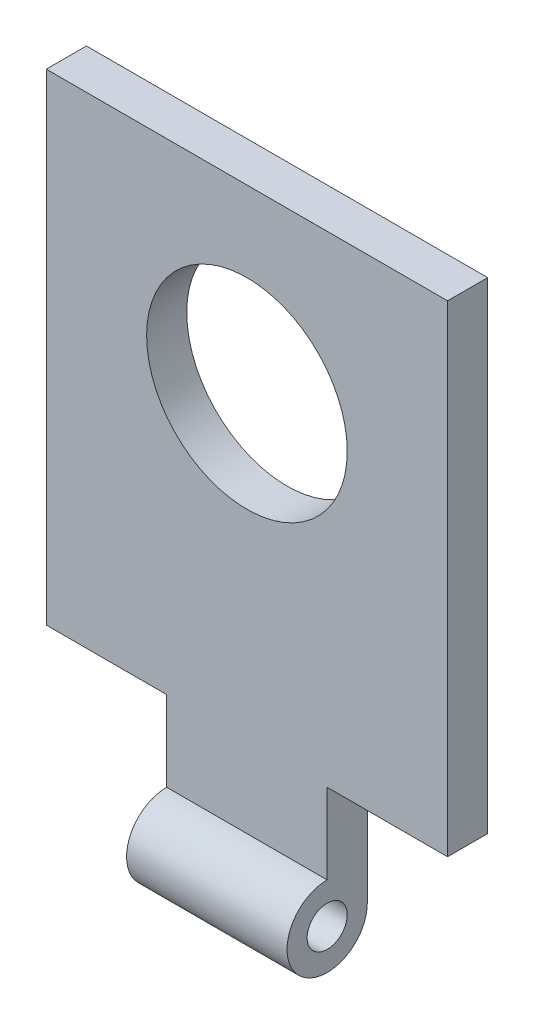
ISO-10303-21;
HEADER;
FILE_DESCRIPTION(('STEP AP214'),'2;1');
FILE_NAME('part.step','',(''),(''),'','','');
FILE_SCHEMA(('AUTOMOTIVE_DESIGN { 1 0 10303 214 1 1 1 1 }'));
ENDSEC;
DATA;
#1=APPLICATION_CONTEXT('core data for automotive mechanical design processes');
#2=APPLICATION_PROTOCOL_DEFINITION('international standard','automotive_design',2000,#1);
#3=PRODUCT_CONTEXT('',#1,'mechanical');
#4=PRODUCT('Part','Part','',(#3));
#5=PRODUCT_RELATED_PRODUCT_CATEGORY('part','',(#4));
#6=PRODUCT_DEFINITION_FORMATION('','',#4);
#7=PRODUCT_DEFINITION_CONTEXT('part definition',#1,'design');
#8=PRODUCT_DEFINITION('design','',#6,#7);
#9=PRODUCT_DEFINITION_SHAPE('','',#8);
#10=(LENGTH_UNIT() NAMED_UNIT(*) SI_UNIT(.MILLI.,.METRE.));
#11=(NAMED_UNIT(*) PLANE_ANGLE_UNIT() SI_UNIT($,.RADIAN.));
#12=(NAMED_UNIT(*) SI_UNIT($,.STERADIAN.) SOLID_ANGLE_UNIT());
#13=UNCERTAINTY_MEASURE_WITH_UNIT(LENGTH_MEASURE(1.E-05),#10,'distance_accuracy_value','');
#14=(GEOMETRIC_REPRESENTATION_CONTEXT(3) GLOBAL_UNCERTAINTY_ASSIGNED_CONTEXT((#13)) GLOBAL_UNIT_ASSIGNED_CONTEXT((#10,
#11,#12)) REPRESENTATION_CONTEXT('',''));
#15=CARTESIAN_POINT('',(0.,0.,0.));
#16=DIRECTION('',(0.,0.,1.));
#17=DIRECTION('',(1.,0.,0.));
#18=AXIS2_PLACEMENT_3D('',#15,#16,#17);
#19=CARTESIAN_POINT('',(0.,0.,10.));
#20=DIRECTION('',(0.,0.,1.));
#21=DIRECTION('',(1.,0.,0.));
#22=AXIS2_PLACEMENT_3D('',#19,#20,#21);
#23=PLANE('',#22);
#24=DIRECTION('',(-1.,0.,0.));
#25=VECTOR('',#24,1.);
#26=CARTESIAN_POINT('',(98.2842712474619,10.,10.));
#27=LINE('',#26,#25);
#28=CARTESIAN_POINT('',(70.,10.,10.));
#29=VERTEX_POINT('',#28);
#30=CARTESIAN_POINT('',(30.,10.,10.));
#31=VERTEX_POINT('',#30);
#32=EDGE_CURVE('E170',#29,#31,#27,.T.);
#33=ORIENTED_EDGE('',*,*,#32,.F.);
#34=DIRECTION('',(0.,1.,0.));
#35=VECTOR('',#34,1.);
#36=CARTESIAN_POINT('',(70.,30.,10.));
#37=LINE('',#36,#35);
#38=CARTESIAN_POINT('',(70.,30.,10.));
#39=VERTEX_POINT('',#38);
#40=EDGE_CURVE('E91',#29,#39,#37,.T.);
#41=ORIENTED_EDGE('',*,*,#40,.T.);
#42=DIRECTION('',(1.,0.,0.));
#43=VECTOR('',#42,1.);
#44=CARTESIAN_POINT('',(70.,30.,10.));
#45=LINE('',#44,#43);
#46=CARTESIAN_POINT('',(100.,30.,10.));
#47=VERTEX_POINT('',#46);
#48=EDGE_CURVE('E187',#39,#47,#45,.T.);
#49=ORIENTED_EDGE('',*,*,#48,.T.);
#50=DIRECTION('',(0.,1.,0.));
#51=VECTOR('',#50,1.);
#52=CARTESIAN_POINT('',(100.,30.,10.));
#53=LINE('',#52,#51);
#54=CARTESIAN_POINT('',(100.,150.,10.));
#55=VERTEX_POINT('',#54);
#56=EDGE_CURVE('E108',#47,#55,#53,.T.);
#57=ORIENTED_EDGE('',*,*,#56,.T.);
#58=DIRECTION('',(-1.,0.,0.));
#59=VECTOR('',#58,1.);
#60=CARTESIAN_POINT('',(0.,150.,10.));
#61=LINE('',#60,#59);
#62=CARTESIAN_POINT('',(0.,150.,10.));
#63=VERTEX_POINT('',#62);
#64=EDGE_CURVE('E101',#55,#63,#61,.T.);
#65=ORIENTED_EDGE('',*,*,#64,.T.);
#66=DIRECTION('',(0.,-1.,0.));
#67=VECTOR('',#66,1.);
#68=CARTESIAN_POINT('',(0.,30.,10.));
#69=LINE('',#68,#67);
#70=CARTESIAN_POINT('',(0.,30.,10.));
#71=VERTEX_POINT('',#70);
#72=EDGE_CURVE('E105',#63,#71,#69,.T.);
#73=ORIENTED_EDGE('',*,*,#72,.T.);
#74=DIRECTION('',(1.,0.,0.));
#75=VECTOR('',#74,1.);
#76=CARTESIAN_POINT('',(30.,30.,10.));
#77=LINE('',#76,#75);
#78=CARTESIAN_POINT('',(30.,30.,10.));
#79=VERTEX_POINT('',#78);
#80=EDGE_CURVE('E50',#71,#79,#77,.T.);
#81=ORIENTED_EDGE('',*,*,#80,.T.);
#82=DIRECTION('',(0.,-1.,0.));
#83=VECTOR('',#82,1.);
#84=CARTESIAN_POINT('',(30.,30.,10.));
#85=LINE('',#84,#83);
#86=EDGE_CURVE('E125',#79,#31,#85,.T.);
#87=ORIENTED_EDGE('',*,*,#86,.T.);
#88=EDGE_LOOP('',(#33,#41,#49,#57,#65,#73,#81,#87));
#89=FACE_BOUND('',#88,.T.);
#90=CARTESIAN_POINT('',(50.,105.,10.));
#91=DIRECTION('',(0.,0.,1.));
#92=DIRECTION('',(1.,0.,0.));
#93=AXIS2_PLACEMENT_3D('',#90,#91,#92);
#94=CIRCLE('',#93,25.);
#95=CARTESIAN_POINT('',(75.,105.,10.));
#96=VERTEX_POINT('',#95);
#97=EDGE_CURVE('E134',#96,#96,#94,.T.);
#98=ORIENTED_EDGE('',*,*,#97,.F.);
#99=EDGE_LOOP('',(#98));
#100=FACE_BOUND('',#99,.T.);
#101=ADVANCED_FACE('F33',(#89,#100),#23,.T.);
#102=CARTESIAN_POINT('',(0.,0.,0.));
#103=DIRECTION('',(0.,0.,1.));
#104=DIRECTION('',(1.,0.,0.));
#105=AXIS2_PLACEMENT_3D('',#102,#103,#104);
#106=PLANE('',#105);
#107=DIRECTION('',(0.,1.,0.));
#108=VECTOR('',#107,1.);
#109=CARTESIAN_POINT('',(70.,30.,0.));
#110=LINE('',#109,#108);
#111=CARTESIAN_POINT('',(70.,0.,0.));
#112=VERTEX_POINT('',#111);
#113=CARTESIAN_POINT('',(70.,30.,0.));
#114=VERTEX_POINT('',#113);
#115=EDGE_CURVE('E131',#112,#114,#110,.T.);
#116=ORIENTED_EDGE('',*,*,#115,.F.);
#117=DIRECTION('',(1.,0.,0.));
#118=VECTOR('',#117,1.);
#119=CARTESIAN_POINT('',(30.,0.,0.));
#120=LINE('',#119,#118);
#121=CARTESIAN_POINT('',(30.,0.,0.));
#122=VERTEX_POINT('',#121);
#123=EDGE_CURVE('E145',#122,#112,#120,.T.);
#124=ORIENTED_EDGE('',*,*,#123,.F.);
#125=DIRECTION('',(0.,-1.,0.));
#126=VECTOR('',#125,1.);
#127=CARTESIAN_POINT('',(30.,30.,0.));
#128=LINE('',#127,#126);
#129=CARTESIAN_POINT('',(30.,30.,0.));
#130=VERTEX_POINT('',#129);
#131=EDGE_CURVE('E142',#130,#122,#128,.T.);
#132=ORIENTED_EDGE('',*,*,#131,.F.);
#133=DIRECTION('',(1.,0.,0.));
#134=VECTOR('',#133,1.);
#135=CARTESIAN_POINT('',(30.,30.,0.));
#136=LINE('',#135,#134);
#137=CARTESIAN_POINT('',(0.,30.,0.));
#138=VERTEX_POINT('',#137);
#139=EDGE_CURVE('E76',#138,#130,#136,.T.);
#140=ORIENTED_EDGE('',*,*,#139,.F.);
#141=DIRECTION('',(0.,-1.,0.));
#142=VECTOR('',#141,1.);
#143=CARTESIAN_POINT('',(0.,30.,0.));
#144=LINE('',#143,#142);
#145=CARTESIAN_POINT('',(0.,150.,0.));
#146=VERTEX_POINT('',#145);
#147=EDGE_CURVE('E139',#146,#138,#144,.T.);
#148=ORIENTED_EDGE('',*,*,#147,.F.);
#149=DIRECTION('',(-1.,0.,0.));
#150=VECTOR('',#149,1.);
#151=CARTESIAN_POINT('',(0.,150.,0.));
#152=LINE('',#151,#150);
#153=CARTESIAN_POINT('',(100.,150.,0.));
#154=VERTEX_POINT('',#153);
#155=EDGE_CURVE('E117',#154,#146,#152,.T.);
#156=ORIENTED_EDGE('',*,*,#155,.F.);
#157=DIRECTION('',(0.,1.,0.));
#158=VECTOR('',#157,1.);
#159=CARTESIAN_POINT('',(100.,30.,0.));
#160=LINE('',#159,#158);
#161=CARTESIAN_POINT('',(100.,30.,0.));
#162=VERTEX_POINT('',#161);
#163=EDGE_CURVE('E136',#162,#154,#160,.T.);
#164=ORIENTED_EDGE('',*,*,#163,.F.);
#165=DIRECTION('',(1.,0.,0.));
#166=VECTOR('',#165,1.);
#167=CARTESIAN_POINT('',(70.,30.,0.));
#168=LINE('',#167,#166);
#169=EDGE_CURVE('E133',#114,#162,#168,.T.);
#170=ORIENTED_EDGE('',*,*,#169,.F.);
#171=EDGE_LOOP('',(#116,#124,#132,#140,#148,#156,#164,#170));
#172=FACE_BOUND('',#171,.T.);
#173=CARTESIAN_POINT('',(50.,105.,0.));
#174=DIRECTION('',(0.,0.,1.));
#175=DIRECTION('',(1.,0.,0.));
#176=AXIS2_PLACEMENT_3D('',#173,#174,#175);
#177=CIRCLE('',#176,25.);
#178=CARTESIAN_POINT('',(75.,105.,0.));
#179=VERTEX_POINT('',#178);
#180=EDGE_CURVE('E176',#179,#179,#177,.T.);
#181=ORIENTED_EDGE('',*,*,#180,.T.);
#182=EDGE_LOOP('',(#181));
#183=FACE_BOUND('',#182,.T.);
#184=ADVANCED_FACE('F157',(#172,#183),#106,.F.);
#185=CARTESIAN_POINT('',(70.,30.,10.));
#186=DIRECTION('',(-1.,0.,0.));
#187=DIRECTION('',(0.,-1.,0.));
#188=AXIS2_PLACEMENT_3D('',#185,#186,#187);
#189=PLANE('',#188);
#190=CARTESIAN_POINT('',(70.,0.,10.));
#191=DIRECTION('',(-1.,0.,0.));
#192=DIRECTION('',(0.,-1.,0.));
#193=AXIS2_PLACEMENT_3D('',#190,#191,#192);
#194=CIRCLE('',#193,5.);
#195=CARTESIAN_POINT('',(70.,-4.99999999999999,10.));
#196=VERTEX_POINT('',#195);
#197=EDGE_CURVE('E178',#196,#196,#194,.T.);
#198=ORIENTED_EDGE('',*,*,#197,.T.);
#199=EDGE_LOOP('',(#198));
#200=FACE_BOUND('',#199,.T.);
#201=ORIENTED_EDGE('',*,*,#40,.F.);
#202=CARTESIAN_POINT('',(70.,0.,10.));
#203=DIRECTION('',(-1.,0.,0.));
#204=DIRECTION('',(0.,-1.,0.));
#205=AXIS2_PLACEMENT_3D('',#202,#203,#204);
#206=CIRCLE('',#205,10.);
#207=EDGE_CURVE('E84',#29,#112,#206,.F.);
#208=ORIENTED_EDGE('',*,*,#207,.T.);
#209=ORIENTED_EDGE('',*,*,#115,.T.);
#210=DIRECTION('',(0.,0.,-1.));
#211=VECTOR('',#210,1.);
#212=CARTESIAN_POINT('',(70.,30.,10.));
#213=LINE('',#212,#211);
#214=EDGE_CURVE('E11',#39,#114,#213,.T.);
#215=ORIENTED_EDGE('',*,*,#214,.F.);
#216=EDGE_LOOP('',(#201,#208,#209,#215));
#217=FACE_BOUND('',#216,.T.);
#218=ADVANCED_FACE('F35',(#200,#217),#189,.F.);
#219=CARTESIAN_POINT('',(70.,30.,10.));
#220=DIRECTION('',(0.,1.,0.));
#221=DIRECTION('',(-1.,0.,0.));
#222=AXIS2_PLACEMENT_3D('',#219,#220,#221);
#223=PLANE('',#222);
#224=ORIENTED_EDGE('',*,*,#169,.T.);
#225=DIRECTION('',(0.,0.,-1.));
#226=VECTOR('',#225,1.);
#227=CARTESIAN_POINT('',(100.,30.,10.));
#228=LINE('',#227,#226);
#229=EDGE_CURVE('E42',#47,#162,#228,.T.);
#230=ORIENTED_EDGE('',*,*,#229,.F.);
#231=ORIENTED_EDGE('',*,*,#48,.F.);
#232=ORIENTED_EDGE('',*,*,#214,.T.);
#233=EDGE_LOOP('',(#224,#230,#231,#232));
#234=FACE_BOUND('',#233,.T.);
#235=ADVANCED_FACE('F189',(#234),#223,.F.);
#236=CARTESIAN_POINT('',(100.,30.,10.));
#237=DIRECTION('',(-1.,0.,0.));
#238=DIRECTION('',(0.,0.,1.));
#239=AXIS2_PLACEMENT_3D('',#236,#237,#238);
#240=PLANE('',#239);
#241=ORIENTED_EDGE('',*,*,#163,.T.);
#242=DIRECTION('',(0.,0.,-1.));
#243=VECTOR('',#242,1.);
#244=CARTESIAN_POINT('',(100.,150.,10.));
#245=LINE('',#244,#243);
#246=EDGE_CURVE('E120',#55,#154,#245,.T.);
#247=ORIENTED_EDGE('',*,*,#246,.F.);
#248=ORIENTED_EDGE('',*,*,#56,.F.);
#249=ORIENTED_EDGE('',*,*,#229,.T.);
#250=EDGE_LOOP('',(#241,#247,#248,#249));
#251=FACE_BOUND('',#250,.T.);
#252=ADVANCED_FACE('F153',(#251),#240,.F.);
#253=CARTESIAN_POINT('',(0.,150.,10.));
#254=DIRECTION('',(0.,-1.,0.));
#255=DIRECTION('',(0.,0.,-1.));
#256=AXIS2_PLACEMENT_3D('',#253,#254,#255);
#257=PLANE('',#256);
#258=ORIENTED_EDGE('',*,*,#155,.T.);
#259=DIRECTION('',(0.,0.,-1.));
#260=VECTOR('',#259,1.);
#261=CARTESIAN_POINT('',(0.,150.,10.));
#262=LINE('',#261,#260);
#263=EDGE_CURVE('E114',#63,#146,#262,.T.);
#264=ORIENTED_EDGE('',*,*,#263,.F.);
#265=ORIENTED_EDGE('',*,*,#64,.F.);
#266=ORIENTED_EDGE('',*,*,#246,.T.);
#267=EDGE_LOOP('',(#258,#264,#265,#266));
#268=FACE_BOUND('',#267,.T.);
#269=ADVANCED_FACE('F115',(#268),#257,.F.);
#270=CARTESIAN_POINT('',(0.,30.,10.));
#271=DIRECTION('',(1.,0.,0.));
#272=DIRECTION('',(0.,1.,0.));
#273=AXIS2_PLACEMENT_3D('',#270,#271,#272);
#274=PLANE('',#273);
#275=ORIENTED_EDGE('',*,*,#147,.T.);
#276=DIRECTION('',(0.,0.,-1.));
#277=VECTOR('',#276,1.);
#278=CARTESIAN_POINT('',(0.,30.,10.));
#279=LINE('',#278,#277);
#280=EDGE_CURVE('E121',#71,#138,#279,.T.);
#281=ORIENTED_EDGE('',*,*,#280,.F.);
#282=ORIENTED_EDGE('',*,*,#72,.F.);
#283=ORIENTED_EDGE('',*,*,#263,.T.);
#284=EDGE_LOOP('',(#275,#281,#282,#283));
#285=FACE_BOUND('',#284,.T.);
#286=ADVANCED_FACE('F123',(#285),#274,.F.);
#287=CARTESIAN_POINT('',(30.,30.,10.));
#288=DIRECTION('',(0.,1.,0.));
#289=DIRECTION('',(-1.,0.,0.));
#290=AXIS2_PLACEMENT_3D('',#287,#288,#289);
#291=PLANE('',#290);
#292=ORIENTED_EDGE('',*,*,#139,.T.);
#293=DIRECTION('',(0.,0.,-1.));
#294=VECTOR('',#293,1.);
#295=CARTESIAN_POINT('',(30.,30.,10.));
#296=LINE('',#295,#294);
#297=EDGE_CURVE('E130',#79,#130,#296,.T.);
#298=ORIENTED_EDGE('',*,*,#297,.F.);
#299=ORIENTED_EDGE('',*,*,#80,.F.);
#300=ORIENTED_EDGE('',*,*,#280,.T.);
#301=EDGE_LOOP('',(#292,#298,#299,#300));
#302=FACE_BOUND('',#301,.T.);
#303=ADVANCED_FACE('F160',(#302),#291,.F.);
#304=CARTESIAN_POINT('',(30.,30.,10.));
#305=DIRECTION('',(1.,0.,0.));
#306=DIRECTION('',(0.,1.,0.));
#307=AXIS2_PLACEMENT_3D('',#304,#305,#306);
#308=PLANE('',#307);
#309=CARTESIAN_POINT('',(30.,0.,10.));
#310=DIRECTION('',(-1.,0.,0.));
#311=DIRECTION('',(0.,-1.,0.));
#312=AXIS2_PLACEMENT_3D('',#309,#310,#311);
#313=CIRCLE('',#312,5.);
#314=CARTESIAN_POINT('',(30.,-5.,10.));
#315=VERTEX_POINT('',#314);
#316=EDGE_CURVE('E300',#315,#315,#313,.T.);
#317=ORIENTED_EDGE('',*,*,#316,.F.);
#318=EDGE_LOOP('',(#317));
#319=FACE_BOUND('',#318,.T.);
#320=ORIENTED_EDGE('',*,*,#131,.T.);
#321=CARTESIAN_POINT('',(30.,0.,10.));
#322=DIRECTION('',(-1.,0.,0.));
#323=DIRECTION('',(0.,-1.,0.));
#324=AXIS2_PLACEMENT_3D('',#321,#322,#323);
#325=CIRCLE('',#324,10.);
#326=EDGE_CURVE('E167',#122,#31,#325,.T.);
#327=ORIENTED_EDGE('',*,*,#326,.T.);
#328=ORIENTED_EDGE('',*,*,#86,.F.);
#329=ORIENTED_EDGE('',*,*,#297,.T.);
#330=EDGE_LOOP('',(#320,#327,#328,#329));
#331=FACE_BOUND('',#330,.T.);
#332=ADVANCED_FACE('F164',(#319,#331),#308,.F.);
#333=CARTESIAN_POINT('',(50.,105.,10.));
#334=DIRECTION('',(0.,0.,-1.));
#335=DIRECTION('',(-1.,0.,0.));
#336=AXIS2_PLACEMENT_3D('',#333,#334,#335);
#337=CYLINDRICAL_SURFACE('',#336,25.);
#338=ORIENTED_EDGE('',*,*,#97,.T.);
#339=EDGE_LOOP('',(#338));
#340=FACE_BOUND('',#339,.T.);
#341=ORIENTED_EDGE('',*,*,#180,.F.);
#342=EDGE_LOOP('',(#341));
#343=FACE_BOUND('',#342,.T.);
#344=ADVANCED_FACE('F203',(#340,#343),#337,.F.);
#345=CARTESIAN_POINT('',(98.2842712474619,0.,10.));
#346=DIRECTION('',(-1.,0.,0.));
#347=DIRECTION('',(0.,-1.,0.));
#348=AXIS2_PLACEMENT_3D('',#345,#346,#347);
#349=CYLINDRICAL_SURFACE('',#348,10.);
#350=ORIENTED_EDGE('',*,*,#207,.F.);
#351=ORIENTED_EDGE('',*,*,#32,.T.);
#352=ORIENTED_EDGE('',*,*,#326,.F.);
#353=ORIENTED_EDGE('',*,*,#123,.T.);
#354=EDGE_LOOP('',(#350,#351,#352,#353));
#355=FACE_BOUND('',#354,.T.);
#356=ADVANCED_FACE('F173',(#355),#349,.T.);
#357=CARTESIAN_POINT('',(100.,0.,10.));
#358=DIRECTION('',(-1.,0.,0.));
#359=DIRECTION('',(0.,-1.,0.));
#360=AXIS2_PLACEMENT_3D('',#357,#358,#359);
#361=CYLINDRICAL_SURFACE('',#360,5.);
#362=ORIENTED_EDGE('',*,*,#316,.T.);
#363=EDGE_LOOP('',(#362));
#364=FACE_BOUND('',#363,.T.);
#365=ORIENTED_EDGE('',*,*,#197,.F.);
#366=EDGE_LOOP('',(#365));
#367=FACE_BOUND('',#366,.T.);
#368=ADVANCED_FACE('F249',(#364,#367),#361,.F.);
#369=CLOSED_SHELL('',(#101,#184,#218,#235,#252,#269,#286,#303,#332,#344,#356,#368));
#370=MANIFOLD_SOLID_BREP('B2',#369);
#371=ADVANCED_BREP_SHAPE_REPRESENTATION('',(#18,#370),#14);
#372=SHAPE_DEFINITION_REPRESENTATION(#9,#371);
ENDSEC;
END-ISO-10303-21;
